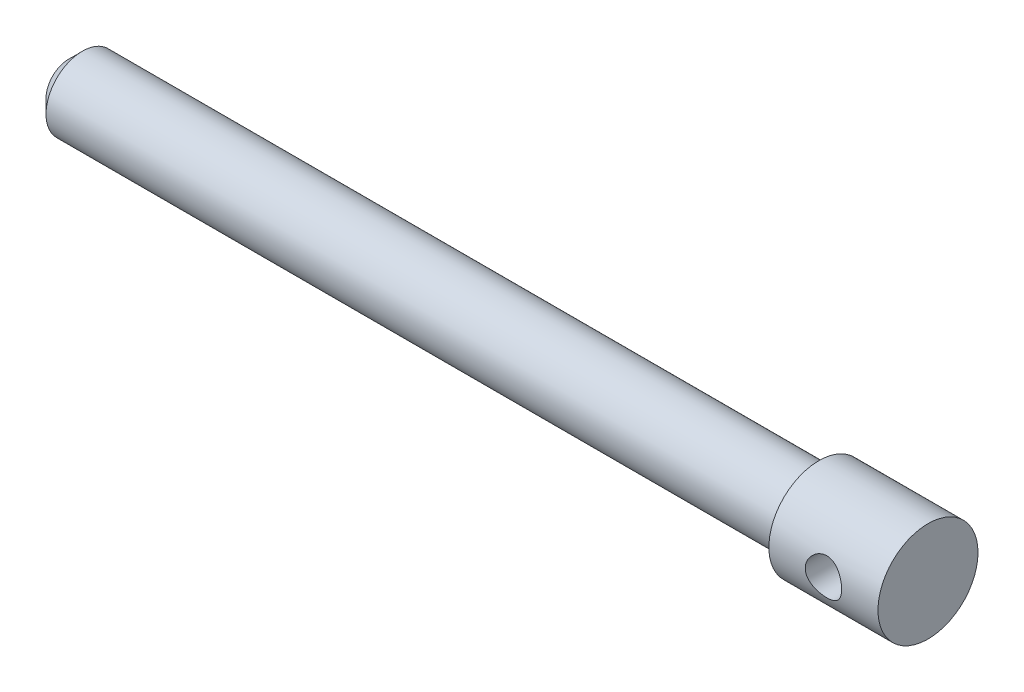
from build123d import *

# Parameters (mm, degrees)
SKETCH1_R               = 8
BOSS_EXTRUDE1_DEPTH     = 82.5
SKETCH2_R               = 11
BOSS_EXTRUDE2_DEPTH     = 24
CHAMFER1_SIZE           = 3
CUT_EXTRUDE1_DEPTH      = 108.630153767
CUT_EXTRUDE1_DEPTH_BACK = 108.630153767
SKETCH3_R               = 4


with BuildPart() as part:
    # Sketch1 → Boss-Extrude1 (new, symmetric)
    with BuildSketch(Plane(origin=(0, 0, 0), x_dir=(0, 0, -1), z_dir=(1, 0, 0))):
        Circle(SKETCH1_R)
    extrude(amount=BOSS_EXTRUDE1_DEPTH, both=True)

    # Sketch2 → Boss-Extrude2 (add)
    with BuildSketch(Plane(origin=(82.5, 0, 0), x_dir=(0, 0, -1), z_dir=(1, 0, 0))):
        Circle(SKETCH2_R)
    extrude(amount=BOSS_EXTRUDE2_DEPTH)

    # Chamfer1
    chamfer1_edges = [part.edges().sort_by_distance(p)[0] for p in [
        (-82.5, 0, 8),
    ]]
    chamfer(chamfer1_edges, length=CHAMFER1_SIZE)

    # Sketch3 → Cut-Extrude1 (cut, two sides: drawn at the far end of the back side and taken through both)
    with BuildSketch(Plane.XY.offset(-CUT_EXTRUDE1_DEPTH_BACK)):
        with Locations((94.5, 0)):
            Circle(SKETCH3_R)
    extrude(amount=CUT_EXTRUDE1_DEPTH + CUT_EXTRUDE1_DEPTH_BACK, mode=Mode.SUBTRACT)


solid = part.part
